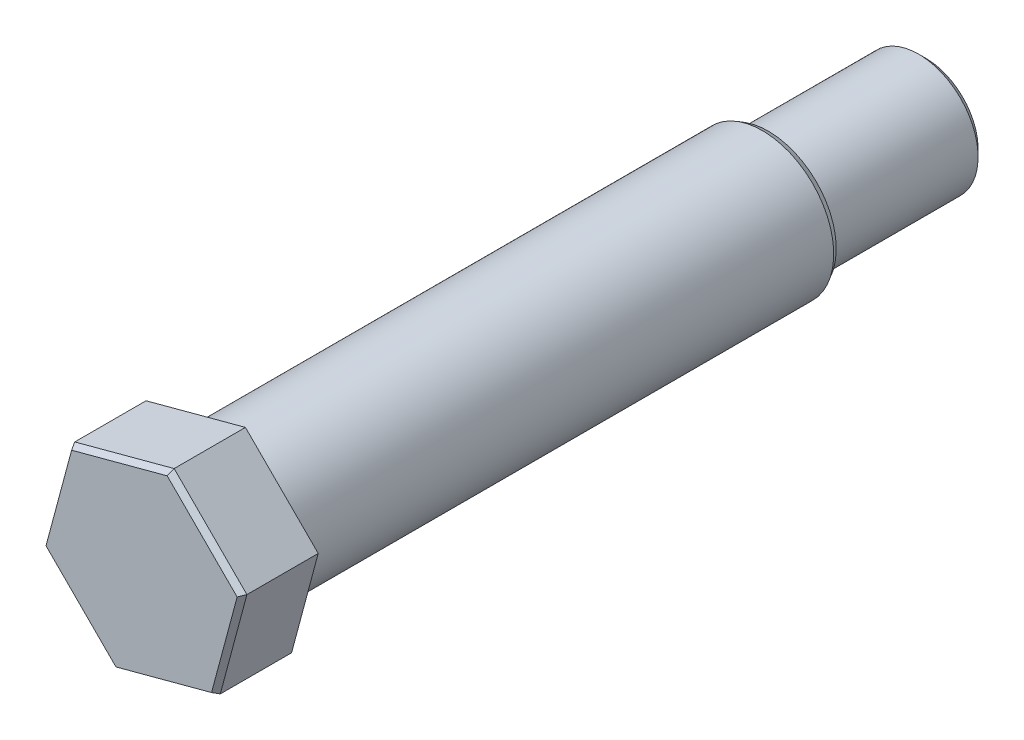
ISO-10303-21;
HEADER;
FILE_DESCRIPTION(('STEP AP214'),'2;1');
FILE_NAME('part.step','',(''),(''),'','','');
FILE_SCHEMA(('AUTOMOTIVE_DESIGN { 1 0 10303 214 1 1 1 1 }'));
ENDSEC;
DATA;
#1=APPLICATION_CONTEXT('core data for automotive mechanical design processes');
#2=APPLICATION_PROTOCOL_DEFINITION('international standard','automotive_design',2000,#1);
#3=PRODUCT_CONTEXT('',#1,'mechanical');
#4=PRODUCT('Part','Part','',(#3));
#5=PRODUCT_RELATED_PRODUCT_CATEGORY('part','',(#4));
#6=PRODUCT_DEFINITION_FORMATION('','',#4);
#7=PRODUCT_DEFINITION_CONTEXT('part definition',#1,'design');
#8=PRODUCT_DEFINITION('design','',#6,#7);
#9=PRODUCT_DEFINITION_SHAPE('','',#8);
#10=(LENGTH_UNIT() NAMED_UNIT(*) SI_UNIT(.MILLI.,.METRE.));
#11=(NAMED_UNIT(*) PLANE_ANGLE_UNIT() SI_UNIT($,.RADIAN.));
#12=(NAMED_UNIT(*) SI_UNIT($,.STERADIAN.) SOLID_ANGLE_UNIT());
#13=UNCERTAINTY_MEASURE_WITH_UNIT(LENGTH_MEASURE(1.E-05),#10,'distance_accuracy_value','');
#14=(GEOMETRIC_REPRESENTATION_CONTEXT(3) GLOBAL_UNCERTAINTY_ASSIGNED_CONTEXT((#13)) GLOBAL_UNIT_ASSIGNED_CONTEXT((#10,
#11,#12)) REPRESENTATION_CONTEXT('',''));
#15=CARTESIAN_POINT('',(0.,0.,0.));
#16=DIRECTION('',(0.,0.,1.));
#17=DIRECTION('',(1.,0.,0.));
#18=AXIS2_PLACEMENT_3D('',#15,#16,#17);
#19=CARTESIAN_POINT('',(0.,0.,-92.5));
#20=DIRECTION('',(0.,0.,-1.));
#21=DIRECTION('',(-1.,0.,0.));
#22=AXIS2_PLACEMENT_3D('',#19,#20,#21);
#23=PLANE('',#22);
#24=CARTESIAN_POINT('',(0.,0.,-92.5));
#25=DIRECTION('',(0.,0.,-1.));
#26=DIRECTION('',(-1.,0.,0.));
#27=AXIS2_PLACEMENT_3D('',#24,#25,#26);
#28=CIRCLE('',#27,10.5);
#29=CARTESIAN_POINT('',(-10.5,0.,-92.5));
#30=VERTEX_POINT('',#29);
#31=EDGE_CURVE('E11',#30,#30,#28,.F.);
#32=ORIENTED_EDGE('',*,*,#31,.T.);
#33=EDGE_LOOP('',(#32));
#34=FACE_BOUND('',#33,.T.);
#35=CARTESIAN_POINT('',(0.,0.,-92.5));
#36=DIRECTION('',(0.,0.,-1.));
#37=DIRECTION('',(-1.,0.,0.));
#38=AXIS2_PLACEMENT_3D('',#35,#36,#37);
#39=CIRCLE('',#38,11.4226497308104);
#40=CARTESIAN_POINT('',(-11.4226497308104,0.,-92.5));
#41=VERTEX_POINT('',#40);
#42=EDGE_CURVE('E175',#41,#41,#39,.T.);
#43=ORIENTED_EDGE('',*,*,#42,.T.);
#44=EDGE_LOOP('',(#43));
#45=FACE_BOUND('',#44,.T.);
#46=ADVANCED_FACE('F34',(#34,#45),#23,.T.);
#47=CARTESIAN_POINT('',(-4.48287736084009,-16.7303260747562,0.));
#48=DIRECTION('',(0.,0.,-1.));
#49=DIRECTION('',(-1.,0.,0.));
#50=AXIS2_PLACEMENT_3D('',#47,#48,#49);
#51=PLANE('',#50);
#52=DIRECTION('',(0.965925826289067,0.258819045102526,0.));
#53=VECTOR('',#52,1.);
#54=CARTESIAN_POINT('',(-4.48287736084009,-16.7303260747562,0.));
#55=LINE('',#54,#53);
#56=CARTESIAN_POINT('',(-4.48287736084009,-16.7303260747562,0.));
#57=VERTEX_POINT('',#56);
#58=CARTESIAN_POINT('',(12.247448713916,-12.2474487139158,0.));
#59=VERTEX_POINT('',#58);
#60=EDGE_CURVE('E120',#57,#59,#55,.T.);
#61=ORIENTED_EDGE('',*,*,#60,.F.);
#62=DIRECTION('',(0.707106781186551,-0.707106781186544,0.));
#63=VECTOR('',#62,1.);
#64=CARTESIAN_POINT('',(-16.730326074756,-4.48287736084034,0.));
#65=LINE('',#64,#63);
#66=CARTESIAN_POINT('',(-16.730326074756,-4.48287736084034,0.));
#67=VERTEX_POINT('',#66);
#68=EDGE_CURVE('E142',#67,#57,#65,.T.);
#69=ORIENTED_EDGE('',*,*,#68,.F.);
#70=DIRECTION('',(-0.258819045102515,-0.96592582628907,0.));
#71=VECTOR('',#70,1.);
#72=CARTESIAN_POINT('',(-12.2474487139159,12.2474487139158,0.));
#73=LINE('',#72,#71);
#74=CARTESIAN_POINT('',(-12.2474487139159,12.2474487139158,0.));
#75=VERTEX_POINT('',#74);
#76=EDGE_CURVE('E139',#75,#67,#73,.T.);
#77=ORIENTED_EDGE('',*,*,#76,.F.);
#78=DIRECTION('',(-0.965925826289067,-0.258819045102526,0.));
#79=VECTOR('',#78,1.);
#80=CARTESIAN_POINT('',(4.48287736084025,16.7303260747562,0.));
#81=LINE('',#80,#79);
#82=CARTESIAN_POINT('',(4.48287736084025,16.7303260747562,0.));
#83=VERTEX_POINT('',#82);
#84=EDGE_CURVE('E136',#83,#75,#81,.T.);
#85=ORIENTED_EDGE('',*,*,#84,.F.);
#86=DIRECTION('',(-0.707106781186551,0.707106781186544,0.));
#87=VECTOR('',#86,1.);
#88=CARTESIAN_POINT('',(16.7303260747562,4.48287736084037,0.));
#89=LINE('',#88,#87);
#90=CARTESIAN_POINT('',(16.7303260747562,4.48287736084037,0.));
#91=VERTEX_POINT('',#90);
#92=EDGE_CURVE('E123',#91,#83,#89,.T.);
#93=ORIENTED_EDGE('',*,*,#92,.F.);
#94=DIRECTION('',(0.258819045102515,0.96592582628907,0.));
#95=VECTOR('',#94,1.);
#96=CARTESIAN_POINT('',(12.247448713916,-12.2474487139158,0.));
#97=LINE('',#96,#95);
#98=EDGE_CURVE('E107',#59,#91,#97,.T.);
#99=ORIENTED_EDGE('',*,*,#98,.F.);
#100=EDGE_LOOP('',(#61,#69,#77,#85,#93,#99));
#101=FACE_BOUND('',#100,.T.);
#102=CARTESIAN_POINT('',(0.,0.,0.));
#103=DIRECTION('',(0.,0.,-1.));
#104=DIRECTION('',(-1.,0.,0.));
#105=AXIS2_PLACEMENT_3D('',#102,#103,#104);
#106=CIRCLE('',#105,12.);
#107=CARTESIAN_POINT('',(-12.,0.,0.));
#108=VERTEX_POINT('',#107);
#109=EDGE_CURVE('E400',#108,#108,#106,.T.);
#110=ORIENTED_EDGE('',*,*,#109,.F.);
#111=EDGE_LOOP('',(#110));
#112=FACE_BOUND('',#111,.T.);
#113=ADVANCED_FACE('F117',(#101,#112),#51,.T.);
#114=CARTESIAN_POINT('',(-4.48287736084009,-16.7303260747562,13.));
#115=DIRECTION('',(-0.258819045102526,0.965925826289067,0.));
#116=DIRECTION('',(-0.965925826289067,-0.258819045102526,0.));
#117=AXIS2_PLACEMENT_3D('',#114,#115,#116);
#118=PLANE('',#117);
#119=DIRECTION('',(0.,0.,-1.));
#120=VECTOR('',#119,1.);
#121=CARTESIAN_POINT('',(12.247448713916,-12.2474487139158,13.));
#122=LINE('',#121,#120);
#123=CARTESIAN_POINT('',(12.247448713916,-12.2474487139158,12.));
#124=VERTEX_POINT('',#123);
#125=EDGE_CURVE('E104',#124,#59,#122,.T.);
#126=ORIENTED_EDGE('',*,*,#125,.F.);
#127=DIRECTION('',(-0.965925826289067,-0.258819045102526,0.));
#128=VECTOR('',#127,1.);
#129=CARTESIAN_POINT('',(-4.48287736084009,-16.7303260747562,12.));
#130=LINE('',#129,#128);
#131=CARTESIAN_POINT('',(-4.48287736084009,-16.7303260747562,12.));
#132=VERTEX_POINT('',#131);
#133=EDGE_CURVE('E173',#124,#132,#130,.T.);
#134=ORIENTED_EDGE('',*,*,#133,.T.);
#135=DIRECTION('',(0.,0.,-1.));
#136=VECTOR('',#135,1.);
#137=CARTESIAN_POINT('',(-4.48287736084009,-16.7303260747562,13.));
#138=LINE('',#137,#136);
#139=EDGE_CURVE('E126',#132,#57,#138,.T.);
#140=ORIENTED_EDGE('',*,*,#139,.T.);
#141=ORIENTED_EDGE('',*,*,#60,.T.);
#142=EDGE_LOOP('',(#126,#134,#140,#141));
#143=FACE_BOUND('',#142,.T.);
#144=ADVANCED_FACE('F36',(#143),#118,.F.);
#145=CARTESIAN_POINT('',(12.247448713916,-12.2474487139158,13.));
#146=DIRECTION('',(-0.96592582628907,0.258819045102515,0.));
#147=DIRECTION('',(-0.258819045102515,-0.96592582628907,0.));
#148=AXIS2_PLACEMENT_3D('',#145,#146,#147);
#149=PLANE('',#148);
#150=DIRECTION('',(0.,0.,-1.));
#151=VECTOR('',#150,1.);
#152=CARTESIAN_POINT('',(16.7303260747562,4.48287736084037,13.));
#153=LINE('',#152,#151);
#154=CARTESIAN_POINT('',(16.7303260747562,4.48287736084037,12.));
#155=VERTEX_POINT('',#154);
#156=EDGE_CURVE('E113',#155,#91,#153,.T.);
#157=ORIENTED_EDGE('',*,*,#156,.F.);
#158=DIRECTION('',(-0.258819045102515,-0.96592582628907,0.));
#159=VECTOR('',#158,1.);
#160=CARTESIAN_POINT('',(12.247448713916,-12.2474487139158,12.));
#161=LINE('',#160,#159);
#162=EDGE_CURVE('E49',#155,#124,#161,.T.);
#163=ORIENTED_EDGE('',*,*,#162,.T.);
#164=ORIENTED_EDGE('',*,*,#125,.T.);
#165=ORIENTED_EDGE('',*,*,#98,.T.);
#166=EDGE_LOOP('',(#157,#163,#164,#165));
#167=FACE_BOUND('',#166,.T.);
#168=ADVANCED_FACE('F106',(#167),#149,.F.);
#169=CARTESIAN_POINT('',(16.7303260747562,4.48287736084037,13.));
#170=DIRECTION('',(-0.707106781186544,-0.707106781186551,0.));
#171=DIRECTION('',(0.707106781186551,-0.707106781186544,0.));
#172=AXIS2_PLACEMENT_3D('',#169,#170,#171);
#173=PLANE('',#172);
#174=DIRECTION('',(0.,0.,-1.));
#175=VECTOR('',#174,1.);
#176=CARTESIAN_POINT('',(4.48287736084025,16.7303260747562,13.));
#177=LINE('',#176,#175);
#178=CARTESIAN_POINT('',(4.48287736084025,16.7303260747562,12.));
#179=VERTEX_POINT('',#178);
#180=EDGE_CURVE('E149',#179,#83,#177,.T.);
#181=ORIENTED_EDGE('',*,*,#180,.F.);
#182=DIRECTION('',(0.707106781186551,-0.707106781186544,0.));
#183=VECTOR('',#182,1.);
#184=CARTESIAN_POINT('',(16.7303260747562,4.48287736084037,12.));
#185=LINE('',#184,#183);
#186=EDGE_CURVE('E57',#179,#155,#185,.T.);
#187=ORIENTED_EDGE('',*,*,#186,.T.);
#188=ORIENTED_EDGE('',*,*,#156,.T.);
#189=ORIENTED_EDGE('',*,*,#92,.T.);
#190=EDGE_LOOP('',(#181,#187,#188,#189));
#191=FACE_BOUND('',#190,.T.);
#192=ADVANCED_FACE('F258',(#191),#173,.F.);
#193=CARTESIAN_POINT('',(4.48287736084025,16.7303260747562,13.));
#194=DIRECTION('',(0.258819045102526,-0.965925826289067,0.));
#195=DIRECTION('',(0.965925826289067,0.258819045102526,0.));
#196=AXIS2_PLACEMENT_3D('',#193,#194,#195);
#197=PLANE('',#196);
#198=DIRECTION('',(0.,0.,-1.));
#199=VECTOR('',#198,1.);
#200=CARTESIAN_POINT('',(-12.2474487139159,12.2474487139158,13.));
#201=LINE('',#200,#199);
#202=CARTESIAN_POINT('',(-12.2474487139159,12.2474487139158,12.));
#203=VERTEX_POINT('',#202);
#204=EDGE_CURVE('E147',#203,#75,#201,.T.);
#205=ORIENTED_EDGE('',*,*,#204,.F.);
#206=DIRECTION('',(0.965925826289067,0.258819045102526,0.));
#207=VECTOR('',#206,1.);
#208=CARTESIAN_POINT('',(4.48287736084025,16.7303260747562,12.));
#209=LINE('',#208,#207);
#210=EDGE_CURVE('E169',#203,#179,#209,.T.);
#211=ORIENTED_EDGE('',*,*,#210,.T.);
#212=ORIENTED_EDGE('',*,*,#180,.T.);
#213=ORIENTED_EDGE('',*,*,#84,.T.);
#214=EDGE_LOOP('',(#205,#211,#212,#213));
#215=FACE_BOUND('',#214,.T.);
#216=ADVANCED_FACE('F254',(#215),#197,.F.);
#217=CARTESIAN_POINT('',(-12.2474487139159,12.2474487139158,13.));
#218=DIRECTION('',(0.96592582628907,-0.258819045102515,0.));
#219=DIRECTION('',(0.258819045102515,0.96592582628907,0.));
#220=AXIS2_PLACEMENT_3D('',#217,#218,#219);
#221=PLANE('',#220);
#222=DIRECTION('',(0.,0.,-1.));
#223=VECTOR('',#222,1.);
#224=CARTESIAN_POINT('',(-16.730326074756,-4.48287736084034,13.));
#225=LINE('',#224,#223);
#226=CARTESIAN_POINT('',(-16.730326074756,-4.48287736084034,12.));
#227=VERTEX_POINT('',#226);
#228=EDGE_CURVE('E145',#227,#67,#225,.T.);
#229=ORIENTED_EDGE('',*,*,#228,.F.);
#230=DIRECTION('',(0.258819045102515,0.96592582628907,0.));
#231=VECTOR('',#230,1.);
#232=CARTESIAN_POINT('',(-12.2474487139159,12.2474487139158,12.));
#233=LINE('',#232,#231);
#234=EDGE_CURVE('E167',#227,#203,#233,.T.);
#235=ORIENTED_EDGE('',*,*,#234,.T.);
#236=ORIENTED_EDGE('',*,*,#204,.T.);
#237=ORIENTED_EDGE('',*,*,#76,.T.);
#238=EDGE_LOOP('',(#229,#235,#236,#237));
#239=FACE_BOUND('',#238,.T.);
#240=ADVANCED_FACE('F250',(#239),#221,.F.);
#241=CARTESIAN_POINT('',(-16.730326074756,-4.48287736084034,13.));
#242=DIRECTION('',(0.707106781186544,0.707106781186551,0.));
#243=DIRECTION('',(-0.707106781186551,0.707106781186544,0.));
#244=AXIS2_PLACEMENT_3D('',#241,#242,#243);
#245=PLANE('',#244);
#246=ORIENTED_EDGE('',*,*,#139,.F.);
#247=DIRECTION('',(-0.707106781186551,0.707106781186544,0.));
#248=VECTOR('',#247,1.);
#249=CARTESIAN_POINT('',(-16.730326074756,-4.48287736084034,12.));
#250=LINE('',#249,#248);
#251=EDGE_CURVE('E164',#132,#227,#250,.T.);
#252=ORIENTED_EDGE('',*,*,#251,.T.);
#253=ORIENTED_EDGE('',*,*,#228,.T.);
#254=ORIENTED_EDGE('',*,*,#68,.T.);
#255=EDGE_LOOP('',(#246,#252,#253,#254));
#256=FACE_BOUND('',#255,.T.);
#257=ADVANCED_FACE('F246',(#256),#245,.F.);
#258=CARTESIAN_POINT('',(-4.48287736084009,-16.7303260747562,13.));
#259=DIRECTION('',(0.,0.,-1.));
#260=DIRECTION('',(-1.,0.,0.));
#261=AXIS2_PLACEMENT_3D('',#258,#259,#260);
#262=PLANE('',#261);
#263=DIRECTION('',(-0.258819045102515,-0.96592582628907,0.));
#264=VECTOR('',#263,1.);
#265=CARTESIAN_POINT('',(-18.4140872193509,-12.9974696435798,13.));
#266=LINE('',#265,#264);
#267=CARTESIAN_POINT('',(-11.7760441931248,11.7760441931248,13.));
#268=VERTEX_POINT('',#267);
#269=CARTESIAN_POINT('',(-16.0863755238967,-4.31033133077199,13.));
#270=VERTEX_POINT('',#269);
#271=EDGE_CURVE('E159',#268,#270,#266,.T.);
#272=ORIENTED_EDGE('',*,*,#271,.T.);
#273=DIRECTION('',(0.707106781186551,-0.707106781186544,0.));
#274=VECTOR('',#273,1.);
#275=CARTESIAN_POINT('',(-4.07462907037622,-16.3220777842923,13.));
#276=LINE('',#275,#274);
#277=CARTESIAN_POINT('',(-4.31033133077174,-16.0863755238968,13.));
#278=VERTEX_POINT('',#277);
#279=EDGE_CURVE('E161',#270,#278,#276,.T.);
#280=ORIENTED_EDGE('',*,*,#279,.T.);
#281=DIRECTION('',(0.965925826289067,0.258819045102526,0.));
#282=VECTOR('',#281,1.);
#283=CARTESIAN_POINT('',(-4.63230660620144,-16.172648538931,13.));
#284=LINE('',#283,#282);
#285=CARTESIAN_POINT('',(11.776044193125,-11.7760441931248,13.));
#286=VERTEX_POINT('',#285);
#287=EDGE_CURVE('E112',#278,#286,#284,.T.);
#288=ORIENTED_EDGE('',*,*,#287,.T.);
#289=DIRECTION('',(0.258819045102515,0.96592582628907,0.));
#290=VECTOR('',#289,1.);
#291=CARTESIAN_POINT('',(9.44833249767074,-20.4631825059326,13.));
#292=LINE('',#291,#290);
#293=CARTESIAN_POINT('',(16.0863755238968,4.31033133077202,13.));
#294=VERTEX_POINT('',#293);
#295=EDGE_CURVE('E153',#286,#294,#292,.T.);
#296=ORIENTED_EDGE('',*,*,#295,.T.);
#297=DIRECTION('',(-0.707106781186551,0.707106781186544,0.));
#298=VECTOR('',#297,1.);
#299=CARTESIAN_POINT('',(16.3220777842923,4.07462907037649,13.));
#300=LINE('',#299,#298);
#301=CARTESIAN_POINT('',(4.3103313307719,16.0863755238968,13.));
#302=VERTEX_POINT('',#301);
#303=EDGE_CURVE('E155',#294,#302,#300,.T.);
#304=ORIENTED_EDGE('',*,*,#303,.T.);
#305=DIRECTION('',(-0.965925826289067,-0.258819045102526,0.));
#306=VECTOR('',#305,1.);
#307=CARTESIAN_POINT('',(-12.0980194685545,11.6897711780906,13.));
#308=LINE('',#307,#306);
#309=EDGE_CURVE('E157',#302,#268,#308,.T.);
#310=ORIENTED_EDGE('',*,*,#309,.T.);
#311=EDGE_LOOP('',(#272,#280,#288,#296,#304,#310));
#312=FACE_BOUND('',#311,.T.);
#313=ADVANCED_FACE('F241',(#312),#262,.F.);
#314=CARTESIAN_POINT('',(16.3220777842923,4.0746290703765,13.));
#315=DIRECTION('',(-0.61237243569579,-0.612372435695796,-0.500000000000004));
#316=DIRECTION('',(0.707106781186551,-0.707106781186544,0.));
#317=AXIS2_PLACEMENT_3D('',#314,#315,#316);
#318=PLANE('',#317);
#319=DIRECTION('',(-0.535799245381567,-0.143566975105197,0.832050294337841));
#320=VECTOR('',#319,1.);
#321=CARTESIAN_POINT('',(12.2750657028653,3.28909394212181,18.9186374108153));
#322=LINE('',#321,#320);
#323=EDGE_CURVE('E131',#155,#294,#322,.T.);
#324=ORIENTED_EDGE('',*,*,#323,.F.);
#325=ORIENTED_EDGE('',*,*,#186,.F.);
#326=DIRECTION('',(-0.143566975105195,-0.535799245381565,0.832050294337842));
#327=VECTOR('',#326,1.);
#328=CARTESIAN_POINT('',(3.63393066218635,13.562013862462,16.9201172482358));
#329=LINE('',#328,#327);
#330=EDGE_CURVE('E128',#302,#179,#329,.F.);
#331=ORIENTED_EDGE('',*,*,#330,.F.);
#332=ORIENTED_EDGE('',*,*,#303,.F.);
#333=EDGE_LOOP('',(#324,#325,#331,#332));
#334=FACE_BOUND('',#333,.T.);
#335=ADVANCED_FACE('F238',(#334),#318,.F.);
#336=CARTESIAN_POINT('',(-12.0980194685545,11.6897711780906,13.));
#337=DIRECTION('',(0.224143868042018,-0.836516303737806,-0.500000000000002));
#338=DIRECTION('',(0.,0.513054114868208,-0.858356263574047));
#339=AXIS2_PLACEMENT_3D('',#336,#337,#338);
#340=PLANE('',#339);
#341=ORIENTED_EDGE('',*,*,#330,.T.);
#342=ORIENTED_EDGE('',*,*,#210,.F.);
#343=DIRECTION('',(0.392232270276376,-0.392232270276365,0.832050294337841));
#344=VECTOR('',#343,1.);
#345=CARTESIAN_POINT('',(-11.8123060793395,11.8123060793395,12.9230769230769));
#346=LINE('',#345,#344);
#347=EDGE_CURVE('E410',#268,#203,#346,.F.);
#348=ORIENTED_EDGE('',*,*,#347,.F.);
#349=ORIENTED_EDGE('',*,*,#309,.F.);
#350=EDGE_LOOP('',(#341,#342,#348,#349));
#351=FACE_BOUND('',#350,.T.);
#352=ADVANCED_FACE('F234',(#351),#340,.F.);
#353=CARTESIAN_POINT('',(9.44833249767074,-20.4631825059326,13.));
#354=DIRECTION('',(-0.836516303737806,0.224143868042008,-0.500000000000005));
#355=DIRECTION('',(-0.513054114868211,0.,0.858356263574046));
#356=AXIS2_PLACEMENT_3D('',#353,#354,#355);
#357=PLANE('',#356);
#358=ORIENTED_EDGE('',*,*,#323,.T.);
#359=ORIENTED_EDGE('',*,*,#295,.F.);
#360=DIRECTION('',(-0.392232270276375,0.392232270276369,0.83205029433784));
#361=VECTOR('',#360,1.);
#362=CARTESIAN_POINT('',(9.92808320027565,-9.92808320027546,16.9201172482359));
#363=LINE('',#362,#361);
#364=EDGE_CURVE('E407',#124,#286,#363,.T.);
#365=ORIENTED_EDGE('',*,*,#364,.F.);
#366=ORIENTED_EDGE('',*,*,#162,.F.);
#367=EDGE_LOOP('',(#358,#359,#365,#366));
#368=FACE_BOUND('',#367,.T.);
#369=ADVANCED_FACE('F230',(#368),#357,.F.);
#370=CARTESIAN_POINT('',(-18.4140872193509,-12.9974696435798,13.));
#371=DIRECTION('',(0.836516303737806,-0.224143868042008,-0.500000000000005));
#372=DIRECTION('',(-0.513054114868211,0.,-0.858356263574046));
#373=AXIS2_PLACEMENT_3D('',#370,#371,#372);
#374=PLANE('',#373);
#375=ORIENTED_EDGE('',*,*,#347,.T.);
#376=ORIENTED_EDGE('',*,*,#234,.F.);
#377=DIRECTION('',(0.535799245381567,0.143566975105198,0.832050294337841));
#378=VECTOR('',#377,1.);
#379=CARTESIAN_POINT('',(-17.4228583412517,-4.66844082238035,10.9245567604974));
#380=LINE('',#379,#378);
#381=EDGE_CURVE('E403',#270,#227,#380,.F.);
#382=ORIENTED_EDGE('',*,*,#381,.F.);
#383=ORIENTED_EDGE('',*,*,#271,.F.);
#384=EDGE_LOOP('',(#375,#376,#382,#383));
#385=FACE_BOUND('',#384,.T.);
#386=ADVANCED_FACE('F226',(#385),#374,.F.);
#387=CARTESIAN_POINT('',(-4.63230660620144,-16.172648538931,13.));
#388=DIRECTION('',(-0.224143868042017,0.836516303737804,-0.500000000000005));
#389=DIRECTION('',(0.,0.513054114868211,0.858356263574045));
#390=AXIS2_PLACEMENT_3D('',#387,#388,#389);
#391=PLANE('',#390);
#392=ORIENTED_EDGE('',*,*,#364,.T.);
#393=ORIENTED_EDGE('',*,*,#287,.F.);
#394=DIRECTION('',(-0.143566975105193,-0.535799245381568,-0.832050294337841));
#395=VECTOR('',#394,1.);
#396=CARTESIAN_POINT('',(-4.32360410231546,-16.1359101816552,12.9230769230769));
#397=LINE('',#396,#395);
#398=EDGE_CURVE('E401',#132,#278,#397,.F.);
#399=ORIENTED_EDGE('',*,*,#398,.F.);
#400=ORIENTED_EDGE('',*,*,#133,.F.);
#401=EDGE_LOOP('',(#392,#393,#399,#400));
#402=FACE_BOUND('',#401,.T.);
#403=ADVANCED_FACE('F222',(#402),#391,.F.);
#404=CARTESIAN_POINT('',(-4.07462907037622,-16.3220777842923,13.));
#405=DIRECTION('',(0.61237243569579,0.612372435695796,-0.500000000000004));
#406=DIRECTION('',(-0.707106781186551,0.707106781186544,0.));
#407=AXIS2_PLACEMENT_3D('',#404,#405,#406);
#408=PLANE('',#407);
#409=ORIENTED_EDGE('',*,*,#381,.T.);
#410=ORIENTED_EDGE('',*,*,#251,.F.);
#411=ORIENTED_EDGE('',*,*,#398,.T.);
#412=ORIENTED_EDGE('',*,*,#279,.F.);
#413=EDGE_LOOP('',(#409,#410,#411,#412));
#414=FACE_BOUND('',#413,.T.);
#415=ADVANCED_FACE('F218',(#414),#408,.F.);
#416=CARTESIAN_POINT('',(0.,0.,-92.5));
#417=DIRECTION('',(0.,0.,1.));
#418=DIRECTION('',(1.,0.,0.));
#419=AXIS2_PLACEMENT_3D('',#416,#417,#418);
#420=CYLINDRICAL_SURFACE('',#419,12.);
#421=CARTESIAN_POINT('',(0.,0.,-91.5));
#422=DIRECTION('',(0.,0.,-1.));
#423=DIRECTION('',(-1.,0.,0.));
#424=AXIS2_PLACEMENT_3D('',#421,#422,#423);
#425=CIRCLE('',#424,12.);
#426=CARTESIAN_POINT('',(-12.,0.,-91.5));
#427=VERTEX_POINT('',#426);
#428=EDGE_CURVE('E178',#427,#427,#425,.F.);
#429=ORIENTED_EDGE('',*,*,#428,.T.);
#430=EDGE_LOOP('',(#429));
#431=FACE_BOUND('',#430,.T.);
#432=ORIENTED_EDGE('',*,*,#109,.T.);
#433=EDGE_LOOP('',(#432));
#434=FACE_BOUND('',#433,.T.);
#435=ADVANCED_FACE('F215',(#431,#434),#420,.T.);
#436=CARTESIAN_POINT('',(0.,0.,-119.));
#437=DIRECTION('',(0.,0.,1.));
#438=DIRECTION('',(1.,0.,0.));
#439=AXIS2_PLACEMENT_3D('',#436,#437,#438);
#440=CYLINDRICAL_SURFACE('',#439,10.);
#441=CARTESIAN_POINT('',(0.,0.,-93.));
#442=DIRECTION('',(0.,0.,-1.));
#443=DIRECTION('',(-1.,0.,0.));
#444=AXIS2_PLACEMENT_3D('',#441,#442,#443);
#445=CIRCLE('',#444,10.);
#446=CARTESIAN_POINT('',(-10.,0.,-93.));
#447=VERTEX_POINT('',#446);
#448=EDGE_CURVE('E42',#447,#447,#445,.T.);
#449=ORIENTED_EDGE('',*,*,#448,.T.);
#450=EDGE_LOOP('',(#449));
#451=FACE_BOUND('',#450,.T.);
#452=CARTESIAN_POINT('',(0.,0.,-117.8));
#453=DIRECTION('',(0.,0.,-1.));
#454=DIRECTION('',(-1.,0.,0.));
#455=AXIS2_PLACEMENT_3D('',#452,#453,#454);
#456=CIRCLE('',#455,10.);
#457=CARTESIAN_POINT('',(-10.,0.,-117.8));
#458=VERTEX_POINT('',#457);
#459=EDGE_CURVE('E184',#458,#458,#456,.F.);
#460=ORIENTED_EDGE('',*,*,#459,.T.);
#461=EDGE_LOOP('',(#460));
#462=FACE_BOUND('',#461,.T.);
#463=ADVANCED_FACE('F189',(#451,#462),#440,.T.);
#464=CARTESIAN_POINT('',(0.,0.,-119.));
#465=DIRECTION('',(0.,0.,-1.));
#466=DIRECTION('',(-1.,0.,0.));
#467=AXIS2_PLACEMENT_3D('',#464,#465,#466);
#468=PLANE('',#467);
#469=CARTESIAN_POINT('',(0.,0.,-119.));
#470=DIRECTION('',(0.,0.,-1.));
#471=DIRECTION('',(-1.,0.,0.));
#472=AXIS2_PLACEMENT_3D('',#469,#470,#471);
#473=CIRCLE('',#472,8.79999999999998);
#474=CARTESIAN_POINT('',(-8.79999999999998,0.,-119.));
#475=VERTEX_POINT('',#474);
#476=EDGE_CURVE('E181',#475,#475,#473,.T.);
#477=ORIENTED_EDGE('',*,*,#476,.T.);
#478=EDGE_LOOP('',(#477));
#479=FACE_BOUND('',#478,.T.);
#480=ADVANCED_FACE('F290',(#479),#468,.T.);
#481=CARTESIAN_POINT('',(0.,0.,-92.5));
#482=DIRECTION('',(0.,0.,1.));
#483=DIRECTION('',(1.,0.,0.));
#484=AXIS2_PLACEMENT_3D('',#481,#482,#483);
#485=CONICAL_SURFACE('',#484,11.4226497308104,0.523598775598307);
#486=ORIENTED_EDGE('',*,*,#428,.F.);
#487=EDGE_LOOP('',(#486));
#488=FACE_BOUND('',#487,.T.);
#489=ORIENTED_EDGE('',*,*,#42,.F.);
#490=EDGE_LOOP('',(#489));
#491=FACE_BOUND('',#490,.T.);
#492=ADVANCED_FACE('F200',(#488,#491),#485,.T.);
#493=CARTESIAN_POINT('',(0.,0.,-119.));
#494=DIRECTION('',(0.,0.,1.));
#495=DIRECTION('',(1.,0.,0.));
#496=AXIS2_PLACEMENT_3D('',#493,#494,#495);
#497=CONICAL_SURFACE('',#496,8.79999999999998,0.785398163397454);
#498=ORIENTED_EDGE('',*,*,#459,.F.);
#499=EDGE_LOOP('',(#498));
#500=FACE_BOUND('',#499,.T.);
#501=ORIENTED_EDGE('',*,*,#476,.F.);
#502=EDGE_LOOP('',(#501));
#503=FACE_BOUND('',#502,.T.);
#504=ADVANCED_FACE('F194',(#500,#503),#497,.T.);
#505=CARTESIAN_POINT('',(0.,0.,-93.));
#506=DIRECTION('',(0.,0.,-1.));
#507=DIRECTION('',(-1.,0.,0.));
#508=AXIS2_PLACEMENT_3D('',#505,#506,#507);
#509=TOROIDAL_SURFACE('',#508,10.5,0.5);
#510=ORIENTED_EDGE('',*,*,#31,.F.);
#511=EDGE_LOOP('',(#510));
#512=FACE_BOUND('',#511,.T.);
#513=ORIENTED_EDGE('',*,*,#448,.F.);
#514=EDGE_LOOP('',(#513));
#515=FACE_BOUND('',#514,.T.);
#516=ADVANCED_FACE('F192',(#512,#515),#509,.F.);
#517=CLOSED_SHELL('',(#46,#113,#144,#168,#192,#216,#240,#257,#313,#335,#352,#369,#386,#403,#415,
#435,#463,#480,#492,#504,#516));
#518=MANIFOLD_SOLID_BREP('B2',#517);
#519=ADVANCED_BREP_SHAPE_REPRESENTATION('',(#18,#518),#14);
#520=SHAPE_DEFINITION_REPRESENTATION(#9,#519);
ENDSEC;
END-ISO-10303-21;
